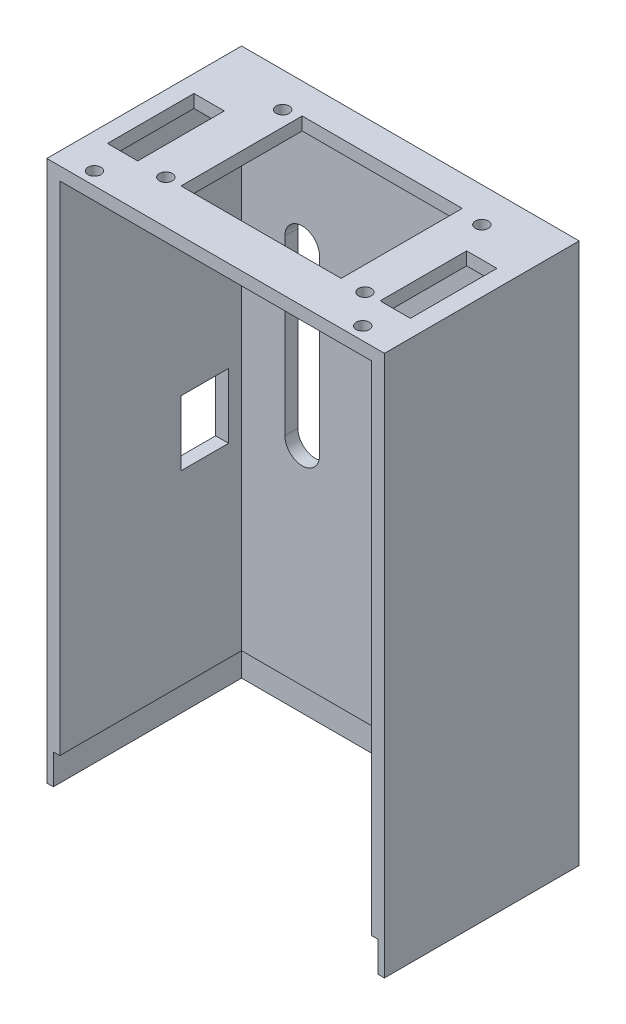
from build123d import *

# Parameters (mm, degrees)
SKETCH2_W           = 78
SKETCH2_H           = 250
BOSS_EXTRUDE1_DEPTH = 3
SKETCH3_W           = 78
SKETCH3_H           = 250
SKETCH3_W_2         = 72
SKETCH3_H_2         = 244
BOSS_EXTRUDE2_DEPTH = 42
SKETCH4_W           = 12
SKETCH4_H           = 12
SKETCH4_W_2         = 9.5
SKETCH4_H_2         = 11
CUT_EXTRUDE3_DEPTH  = 7
SKETCH6_W           = 11
SKETCH6_H           = 15
CUT_EXTRUDE4_DEPTH  = 6
SKETCH9_R           = 1.5
CUT_EXTRUDE6_DEPTH  = 257.994163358
CUT_EXTRUDE8_DEPTH  = 139.459380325
SKETCH16_R          = 1.5
CUT_EXTRUDE9_DEPTH  = 139.459380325
SKETCH19_W          = 37
SKETCH19_H          = 28
CUT_EXTRUDE11_DEPTH = 15
SKETCH25_W          = 7
SKETCH25_H          = 20
CUT_EXTRUDE16_DEPTH = 4
SKETCH27_R          = 1.5
CUT_EXTRUDE17_DEPTH = 10
CUT_EXTRUDE19_DEPTH = 138.513635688
SKETCH29_W          = 78
SKETCH29_H          = 125
CUT_EXTRUDE20_DEPTH = 138.513635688
SKETCH30_W          = 72
SKETCH30_H          = 7
CUT_EXTRUDE21_DEPTH = 1.5
SKETCH31_W          = 1.5
SKETCH31_H          = 7
CUT_EXTRUDE22_DEPTH = 43.5


with BuildPart() as part:
    # Sketch2 → Boss-Extrude1 (new body)
    with BuildSketch(Plane.XY):
        Rectangle(SKETCH2_W, SKETCH2_H)
    extrude(amount=BOSS_EXTRUDE1_DEPTH)

    # Sketch3 → Boss-Extrude2 (add)
    with BuildSketch(Plane.XY.offset(3)):
        Rectangle(SKETCH3_W, SKETCH3_H)
        Rectangle(SKETCH3_W_2, SKETCH3_H_2, mode=Mode.SUBTRACT)
    extrude(amount=BOSS_EXTRUDE2_DEPTH)

    # Sketch4 → Cut-Extrude3 (cut)
    with BuildSketch(Plane.XZ.offset(125)):
        with Locations((-10.5, 13)):
            Rectangle(SKETCH4_W, SKETCH4_H)
        with Locations((19.25, 12.5)):
            Rectangle(SKETCH4_W_2, SKETCH4_H_2)
    extrude(amount=-CUT_EXTRUDE3_DEPTH, mode=Mode.SUBTRACT)

    # Sketch6 → Cut-Extrude4 (cut)
    with BuildSketch(Plane.ZY.offset(39)):
        with Locations((11.5, 57.5)):
            Rectangle(SKETCH6_W, SKETCH6_H)
    extrude(amount=-CUT_EXTRUDE4_DEPTH, mode=Mode.SUBTRACT)

    # Sketch9 → Cut-Extrude6 (cut, through all)
    with BuildSketch(Plane.XZ.offset(125)):
        with Locations(Location((-31, 42, 0), (0, 0, 270))):
            Circle(SKETCH9_R)
        with Locations(Location((31, 42, 0), (0, 0, 270))):
            Circle(SKETCH9_R)
    extrude(amount=-CUT_EXTRUDE6_DEPTH, mode=Mode.SUBTRACT)

    # Sketch14 → Cut-Extrude8 (cut, through all)
    with BuildSketch(Plane(origin=(0, 0, 0), x_dir=(-1, 0, 0), z_dir=(0, 0, -1))):
        with BuildLine():
            Line((26, 95), (26, 55))
            ThreePointArc((26, 55), (22, 51), (18, 55))
            Line((18, 55), (18, 95))
            ThreePointArc((18, 95), (22, 99), (26, 95))
        make_face()
        with BuildLine():
            Line((-18, 95), (-18, 55))
            ThreePointArc((-18, 55), (-22, 51), (-26, 55))
            Line((-26, 55), (-26, 95))
            ThreePointArc((-26, 95), (-22, 99), (-18, 95))
        make_face()
        with BuildLine():
            Line((26, -35), (26, -75))
            ThreePointArc((26, -75), (22, -79), (18, -75))
            Line((18, -75), (18, -35))
            ThreePointArc((18, -35), (22, -31), (26, -35))
        make_face()
        with BuildLine():
            Line((-18, -35), (-18, -75))
            ThreePointArc((-18, -75), (-22, -79), (-26, -75))
            Line((-26, -75), (-26, -35))
            ThreePointArc((-26, -35), (-22, -31), (-18, -35))
        make_face()
    extrude(amount=-CUT_EXTRUDE8_DEPTH, mode=Mode.SUBTRACT)

    # Sketch16 → Cut-Extrude9 (cut, through all)
    with BuildSketch(Plane(origin=(0, 0, 0), x_dir=(-1, 0, 0), z_dir=(0, 0, -1))):
        with Locations((30, 115)):
            Circle(SKETCH16_R)
        with Locations((-30, 115)):
            Circle(SKETCH16_R)
        with Locations((30, -114)):
            Circle(SKETCH16_R)
        with Locations((-30, -114)):
            Circle(SKETCH16_R)
    extrude(amount=-CUT_EXTRUDE9_DEPTH, mode=Mode.SUBTRACT)

    # Sketch19 → Cut-Extrude11 (cut)
    with BuildSketch(Plane(origin=(0, 125, 0), x_dir=(1, 0, 0), z_dir=(0, 1, 0))):
        with Locations((0.5, -21)):
            Rectangle(SKETCH19_W, SKETCH19_H)
    extrude(amount=-CUT_EXTRUDE11_DEPTH, mode=Mode.SUBTRACT)

    # Sketch25 → Cut-Extrude16 (cut)
    with BuildSketch(Plane(origin=(0, 125, 0), x_dir=(1, 0, 0), z_dir=(0, 1, 0))):
        with Locations((-31.5, -25)):
            Rectangle(SKETCH25_W, SKETCH25_H)
        with Locations((31.5, -25)):
            Rectangle(SKETCH25_W, SKETCH25_H)
    extrude(amount=-CUT_EXTRUDE16_DEPTH, mode=Mode.SUBTRACT)

    # Sketch27 → Cut-Extrude17 (cut)
    with BuildSketch(Plane(origin=(0, 125, 0), x_dir=(1, 0, 0), z_dir=(0, 1, 0))):
        with Locations(Location((-21.504408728, -8, 0), (0, 0, 270))):
            Circle(SKETCH27_R)
        with Locations(Location((24.504408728, -8, 0), (0, 0, 270))):
            Circle(SKETCH27_R)
        with Locations(Location((-21.504408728, -35, 0), (0, 0, 270))):
            Circle(SKETCH27_R)
        with Locations(Location((24.504408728, -35, 0), (0, 0, 270))):
            Circle(SKETCH27_R)
    extrude(amount=-CUT_EXTRUDE17_DEPTH, mode=Mode.SUBTRACT)

    # Sketch28 → Cut-Extrude19 (cut, through all)
    with BuildSketch(Plane.XY.offset(3)):
        Polygon((-39, -125), (-39, 0), (-36, 0), (-36, -9.054539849), (36, -9.054539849), (36, 0), (39, 0), (39, -125), align=None)
    extrude(amount=CUT_EXTRUDE19_DEPTH, mode=Mode.SUBTRACT)

    # Sketch29 → Cut-Extrude20 (cut, through all)
    with BuildSketch(Plane.XY.offset(3)):
        with Locations((0, -62.5)):
            Rectangle(SKETCH29_W, SKETCH29_H)
    extrude(amount=-CUT_EXTRUDE20_DEPTH, mode=Mode.SUBTRACT)

    # Sketch30 → Cut-Extrude21 (cut)
    with BuildSketch(Plane.XY.offset(3)):
        with Locations((0, 3.5)):
            Rectangle(SKETCH30_W, SKETCH30_H)
    extrude(amount=-CUT_EXTRUDE21_DEPTH, mode=Mode.SUBTRACT)

    # Sketch31 → Cut-Extrude22 (cut)
    with BuildSketch(Plane.XY.offset(45)):
        with Locations((-36.75, 3.5)):
            Rectangle(SKETCH31_W, SKETCH31_H)
        with Locations((36.75, 3.5)):
            Rectangle(SKETCH31_W, SKETCH31_H)
    extrude(amount=-CUT_EXTRUDE22_DEPTH, mode=Mode.SUBTRACT)


solid = part.part
